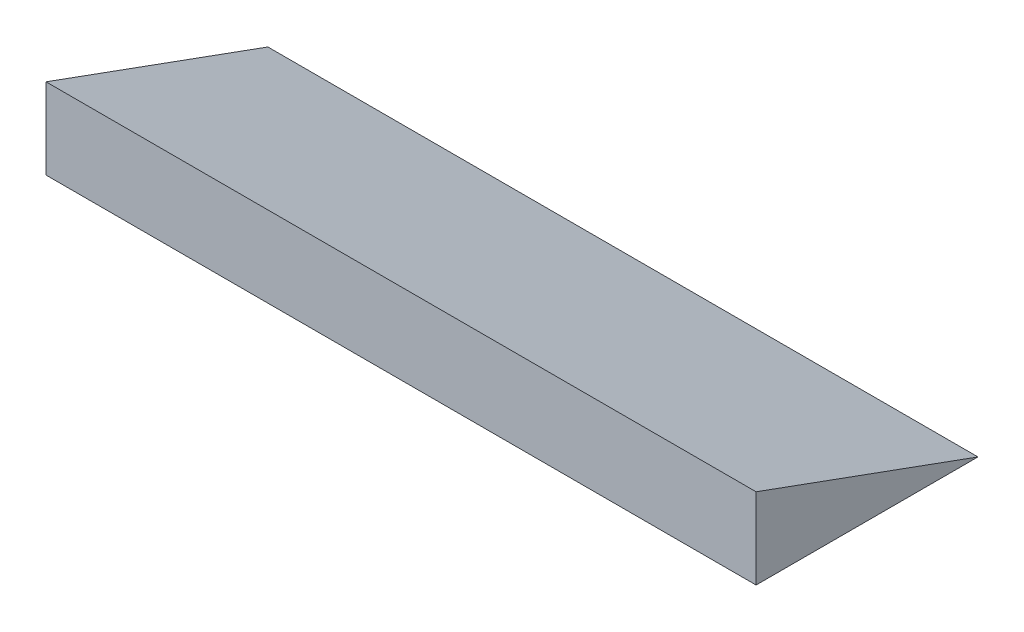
ISO-10303-21;
HEADER;
FILE_DESCRIPTION(('STEP AP214'),'2;1');
FILE_NAME('part.step','',(''),(''),'','','');
FILE_SCHEMA(('AUTOMOTIVE_DESIGN { 1 0 10303 214 1 1 1 1 }'));
ENDSEC;
DATA;
#1=APPLICATION_CONTEXT('core data for automotive mechanical design processes');
#2=APPLICATION_PROTOCOL_DEFINITION('international standard','automotive_design',2000,#1);
#3=PRODUCT_CONTEXT('',#1,'mechanical');
#4=PRODUCT('Part','Part','',(#3));
#5=PRODUCT_RELATED_PRODUCT_CATEGORY('part','',(#4));
#6=PRODUCT_DEFINITION_FORMATION('','',#4);
#7=PRODUCT_DEFINITION_CONTEXT('part definition',#1,'design');
#8=PRODUCT_DEFINITION('design','',#6,#7);
#9=PRODUCT_DEFINITION_SHAPE('','',#8);
#10=(LENGTH_UNIT() NAMED_UNIT(*) SI_UNIT(.MILLI.,.METRE.));
#11=(NAMED_UNIT(*) PLANE_ANGLE_UNIT() SI_UNIT($,.RADIAN.));
#12=(NAMED_UNIT(*) SI_UNIT($,.STERADIAN.) SOLID_ANGLE_UNIT());
#13=UNCERTAINTY_MEASURE_WITH_UNIT(LENGTH_MEASURE(1.E-05),#10,'distance_accuracy_value','');
#14=(GEOMETRIC_REPRESENTATION_CONTEXT(3) GLOBAL_UNCERTAINTY_ASSIGNED_CONTEXT((#13)) GLOBAL_UNIT_ASSIGNED_CONTEXT((#10,
#11,#12)) REPRESENTATION_CONTEXT('',''));
#15=CARTESIAN_POINT('',(0.,0.,0.));
#16=DIRECTION('',(0.,0.,1.));
#17=DIRECTION('',(1.,0.,0.));
#18=AXIS2_PLACEMENT_3D('',#15,#16,#17);
#19=CARTESIAN_POINT('',(1600.,0.,0.));
#20=DIRECTION('',(0.,0.,-1.));
#21=DIRECTION('',(-1.,0.,0.));
#22=AXIS2_PLACEMENT_3D('',#19,#20,#21);
#23=PLANE('',#22);
#24=DIRECTION('',(0.,-1.,0.));
#25=VECTOR('',#24,1.);
#26=CARTESIAN_POINT('',(0.,0.,0.));
#27=LINE('',#26,#25);
#28=CARTESIAN_POINT('',(0.,181.985117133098,0.));
#29=VERTEX_POINT('',#28);
#30=CARTESIAN_POINT('',(0.,0.,0.));
#31=VERTEX_POINT('',#30);
#32=EDGE_CURVE('E81',#29,#31,#27,.T.);
#33=ORIENTED_EDGE('',*,*,#32,.T.);
#34=DIRECTION('',(-1.,0.,0.));
#35=VECTOR('',#34,1.);
#36=CARTESIAN_POINT('',(1600.,0.,0.));
#37=LINE('',#36,#35);
#38=CARTESIAN_POINT('',(1600.,0.,0.));
#39=VERTEX_POINT('',#38);
#40=EDGE_CURVE('E11',#39,#31,#37,.T.);
#41=ORIENTED_EDGE('',*,*,#40,.F.);
#42=DIRECTION('',(0.,-1.,0.));
#43=VECTOR('',#42,1.);
#44=CARTESIAN_POINT('',(1600.,0.,0.));
#45=LINE('',#44,#43);
#46=CARTESIAN_POINT('',(1600.,181.985117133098,0.));
#47=VERTEX_POINT('',#46);
#48=EDGE_CURVE('E74',#47,#39,#45,.T.);
#49=ORIENTED_EDGE('',*,*,#48,.F.);
#50=DIRECTION('',(-1.,0.,0.));
#51=VECTOR('',#50,1.);
#52=CARTESIAN_POINT('',(1600.,181.985117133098,0.));
#53=LINE('',#52,#51);
#54=EDGE_CURVE('E82',#47,#29,#53,.T.);
#55=ORIENTED_EDGE('',*,*,#54,.T.);
#56=EDGE_LOOP('',(#33,#41,#49,#55));
#57=FACE_BOUND('',#56,.T.);
#58=ADVANCED_FACE('F34',(#57),#23,.F.);
#59=CARTESIAN_POINT('',(1600.,0.,0.));
#60=DIRECTION('',(0.,1.,0.));
#61=DIRECTION('',(0.,0.,1.));
#62=AXIS2_PLACEMENT_3D('',#59,#60,#61);
#63=PLANE('',#62);
#64=CARTESIAN_POINT('',(1050.,0.,-250.));
#65=DIRECTION('',(0.,-1.,0.));
#66=DIRECTION('',(0.,0.,1.));
#67=AXIS2_PLACEMENT_3D('',#64,#65,#66);
#68=CIRCLE('',#67,5.00000000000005);
#69=CARTESIAN_POINT('',(1050.,0.,-245.));
#70=VERTEX_POINT('',#69);
#71=EDGE_CURVE('E118',#70,#70,#68,.T.);
#72=ORIENTED_EDGE('',*,*,#71,.F.);
#73=EDGE_LOOP('',(#72));
#74=FACE_BOUND('',#73,.T.);
#75=CARTESIAN_POINT('',(550.,0.,-250.));
#76=DIRECTION('',(0.,-1.,0.));
#77=DIRECTION('',(0.,0.,-1.));
#78=AXIS2_PLACEMENT_3D('',#75,#76,#77);
#79=CIRCLE('',#78,5.00000000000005);
#80=CARTESIAN_POINT('',(550.,0.,-255.));
#81=VERTEX_POINT('',#80);
#82=EDGE_CURVE('E88',#81,#81,#79,.T.);
#83=ORIENTED_EDGE('',*,*,#82,.F.);
#84=EDGE_LOOP('',(#83));
#85=FACE_BOUND('',#84,.T.);
#86=DIRECTION('',(0.,0.,-1.));
#87=VECTOR('',#86,1.);
#88=CARTESIAN_POINT('',(0.,0.,0.));
#89=LINE('',#88,#87);
#90=CARTESIAN_POINT('',(0.,0.,-500.));
#91=VERTEX_POINT('',#90);
#92=EDGE_CURVE('E62',#31,#91,#89,.T.);
#93=ORIENTED_EDGE('',*,*,#92,.T.);
#94=DIRECTION('',(-1.,0.,0.));
#95=VECTOR('',#94,1.);
#96=CARTESIAN_POINT('',(1600.,0.,-500.));
#97=LINE('',#96,#95);
#98=CARTESIAN_POINT('',(1600.,0.,-500.));
#99=VERTEX_POINT('',#98);
#100=EDGE_CURVE('E42',#99,#91,#97,.T.);
#101=ORIENTED_EDGE('',*,*,#100,.F.);
#102=DIRECTION('',(0.,0.,-1.));
#103=VECTOR('',#102,1.);
#104=CARTESIAN_POINT('',(1600.,0.,0.));
#105=LINE('',#104,#103);
#106=EDGE_CURVE('E70',#39,#99,#105,.T.);
#107=ORIENTED_EDGE('',*,*,#106,.F.);
#108=ORIENTED_EDGE('',*,*,#40,.T.);
#109=EDGE_LOOP('',(#93,#101,#107,#108));
#110=FACE_BOUND('',#109,.T.);
#111=ADVANCED_FACE('F71',(#74,#85,#110),#63,.F.);
#112=CARTESIAN_POINT('',(1600.,0.,-500.));
#113=DIRECTION('',(0.,-0.93969262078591,0.342020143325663));
#114=DIRECTION('',(0.,-0.342020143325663,-0.939692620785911));
#115=AXIS2_PLACEMENT_3D('',#112,#113,#114);
#116=PLANE('',#115);
#117=DIRECTION('',(0.,0.342020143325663,0.93969262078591));
#118=VECTOR('',#117,1.);
#119=CARTESIAN_POINT('',(0.,0.,-500.));
#120=LINE('',#119,#118);
#121=EDGE_CURVE('E67',#91,#29,#120,.T.);
#122=ORIENTED_EDGE('',*,*,#121,.T.);
#123=ORIENTED_EDGE('',*,*,#54,.F.);
#124=DIRECTION('',(0.,0.342020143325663,0.93969262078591));
#125=VECTOR('',#124,1.);
#126=CARTESIAN_POINT('',(1600.,0.,-500.));
#127=LINE('',#126,#125);
#128=EDGE_CURVE('E50',#99,#47,#127,.T.);
#129=ORIENTED_EDGE('',*,*,#128,.F.);
#130=ORIENTED_EDGE('',*,*,#100,.T.);
#131=EDGE_LOOP('',(#122,#123,#129,#130));
#132=FACE_BOUND('',#131,.T.);
#133=ADVANCED_FACE('F93',(#132),#116,.F.);
#134=CARTESIAN_POINT('',(1600.,0.,0.));
#135=DIRECTION('',(-1.,0.,0.));
#136=DIRECTION('',(0.,0.,1.));
#137=AXIS2_PLACEMENT_3D('',#134,#135,#136);
#138=PLANE('',#137);
#139=ORIENTED_EDGE('',*,*,#48,.T.);
#140=ORIENTED_EDGE('',*,*,#106,.T.);
#141=ORIENTED_EDGE('',*,*,#128,.T.);
#142=EDGE_LOOP('',(#139,#140,#141));
#143=FACE_BOUND('',#142,.T.);
#144=ADVANCED_FACE('F77',(#143),#138,.F.);
#145=CARTESIAN_POINT('',(0.,0.,0.));
#146=DIRECTION('',(-1.,0.,0.));
#147=DIRECTION('',(0.,0.,1.));
#148=AXIS2_PLACEMENT_3D('',#145,#146,#147);
#149=PLANE('',#148);
#150=ORIENTED_EDGE('',*,*,#32,.F.);
#151=ORIENTED_EDGE('',*,*,#121,.F.);
#152=ORIENTED_EDGE('',*,*,#92,.F.);
#153=EDGE_LOOP('',(#150,#151,#152));
#154=FACE_BOUND('',#153,.T.);
#155=ADVANCED_FACE('F94',(#154),#149,.T.);
#156=CARTESIAN_POINT('',(550.,10.,-250.));
#157=DIRECTION('',(0.,-1.,0.));
#158=DIRECTION('',(0.,0.,-1.));
#159=AXIS2_PLACEMENT_3D('',#156,#157,#158);
#160=CYLINDRICAL_SURFACE('',#159,5.00000000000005);
#161=CARTESIAN_POINT('',(550.,10.,-250.));
#162=DIRECTION('',(0.,-1.,0.));
#163=DIRECTION('',(0.,0.,-1.));
#164=AXIS2_PLACEMENT_3D('',#161,#162,#163);
#165=CIRCLE('',#164,5.00000000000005);
#166=CARTESIAN_POINT('',(550.,10.,-255.));
#167=VERTEX_POINT('',#166);
#168=EDGE_CURVE('E84',#167,#167,#165,.T.);
#169=ORIENTED_EDGE('',*,*,#168,.F.);
#170=EDGE_LOOP('',(#169));
#171=FACE_BOUND('',#170,.T.);
#172=ORIENTED_EDGE('',*,*,#82,.T.);
#173=EDGE_LOOP('',(#172));
#174=FACE_BOUND('',#173,.T.);
#175=ADVANCED_FACE('F96',(#171,#174),#160,.F.);
#176=CARTESIAN_POINT('',(550.,10.,-250.));
#177=DIRECTION('',(0.,-1.,0.));
#178=DIRECTION('',(0.,0.,-1.));
#179=AXIS2_PLACEMENT_3D('',#176,#177,#178);
#180=PLANE('',#179);
#181=ORIENTED_EDGE('',*,*,#168,.T.);
#182=EDGE_LOOP('',(#181));
#183=FACE_BOUND('',#182,.T.);
#184=ADVANCED_FACE('F102',(#183),#180,.T.);
#185=CARTESIAN_POINT('',(1050.,10.,-250.));
#186=DIRECTION('',(0.,-1.,0.));
#187=DIRECTION('',(0.,0.,-1.));
#188=AXIS2_PLACEMENT_3D('',#185,#186,#187);
#189=CYLINDRICAL_SURFACE('',#188,5.00000000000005);
#190=CARTESIAN_POINT('',(1050.,10.,-250.));
#191=DIRECTION('',(0.,-1.,0.));
#192=DIRECTION('',(0.,0.,1.));
#193=AXIS2_PLACEMENT_3D('',#190,#191,#192);
#194=CIRCLE('',#193,5.00000000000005);
#195=CARTESIAN_POINT('',(1050.,10.,-245.));
#196=VERTEX_POINT('',#195);
#197=EDGE_CURVE('E122',#196,#196,#194,.T.);
#198=ORIENTED_EDGE('',*,*,#197,.F.);
#199=EDGE_LOOP('',(#198));
#200=FACE_BOUND('',#199,.T.);
#201=ORIENTED_EDGE('',*,*,#71,.T.);
#202=EDGE_LOOP('',(#201));
#203=FACE_BOUND('',#202,.T.);
#204=ADVANCED_FACE('F128',(#200,#203),#189,.F.);
#205=CARTESIAN_POINT('',(1050.,10.,-250.));
#206=DIRECTION('',(0.,1.,0.));
#207=DIRECTION('',(0.,0.,1.));
#208=AXIS2_PLACEMENT_3D('',#205,#206,#207);
#209=PLANE('',#208);
#210=ORIENTED_EDGE('',*,*,#197,.T.);
#211=EDGE_LOOP('',(#210));
#212=FACE_BOUND('',#211,.T.);
#213=ADVANCED_FACE('F130',(#212),#209,.F.);
#214=CLOSED_SHELL('',(#58,#111,#133,#144,#155,#175,#184,#204,#213));
#215=MANIFOLD_SOLID_BREP('B2',#214);
#216=ADVANCED_BREP_SHAPE_REPRESENTATION('',(#18,#215),#14);
#217=SHAPE_DEFINITION_REPRESENTATION(#9,#216);
ENDSEC;
END-ISO-10303-21;
